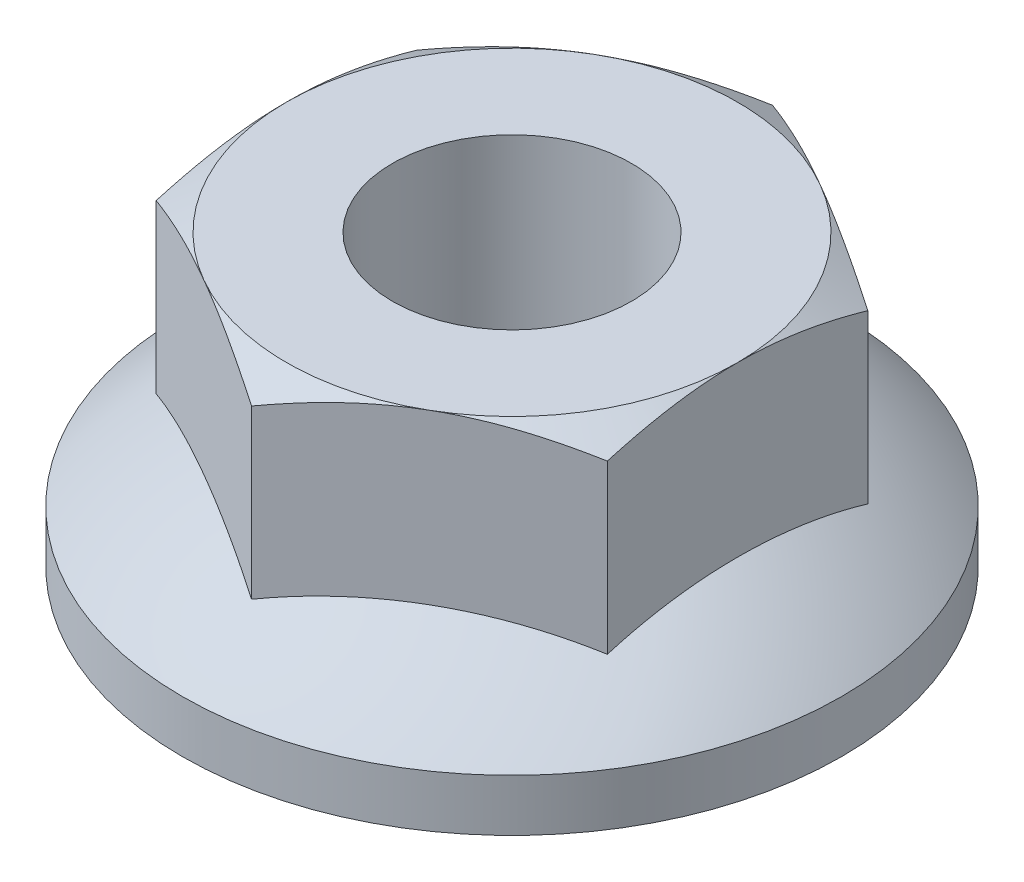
from build123d import *

# Parameters (mm, degrees)
BOSS_EXTRUDE1_DEPTH = 5
TAP1_D              = 4.134


with BuildPart() as part:
    # Sketch1 → Revolve1 (revolve)
    with BuildSketch(Plane.XY, mode=Mode.PRIVATE) as revolve1_sk:
        with BuildLine():
            Line((0, 0), (-5.7, 0))
            Line((-5.7, 0), (-5.7, 0.9))
            ThreePointArc((-5.7, 0.9), (-3.03726851, 2.458300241), (0, 3))
            Line((0, 3), (0, 0))
        make_face()
    revolve(revolve1_sk.sketch.rotate(Axis((0, 55, 0), (0, -1, 0)), 180), axis=Axis((0, 55, 0), (0, -1, 0)))

    # Sketch2 → Boss-Extrude1 (add)
    with BuildSketch(Plane.XZ):
        Polygon((0, 4.5033321), (-3.9, 2.25166605), (-3.9, -2.25166605), (0, -4.5033321), (3.9, -2.25166605), (3.9, 2.25166605), align=None)
    extrude(amount=-BOSS_EXTRUDE1_DEPTH)

    # Sketch3 → Cut-Revolve1 (revolve, cut)
    with BuildSketch(Plane.XY, mode=Mode.PRIVATE) as cut_revolve1_sk:
        Polygon((-3.9, 5), (-5.9, 5), (-5.9, 3.845299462), align=None)
    revolve(cut_revolve1_sk.sketch.rotate(Axis((0, 55, 0), (0, -1, 0)), 270), axis=Axis((0, 55, 0), (0, -1, 0)), mode=Mode.SUBTRACT)

    # Tap1 (through all)
    with Locations(Plane(origin=(0, 5, 0), x_dir=(1, 0, 0), z_dir=(0, 1, 0))):
        with Locations((0, 0)):
            Hole(TAP1_D / 2)


solid = part.part
